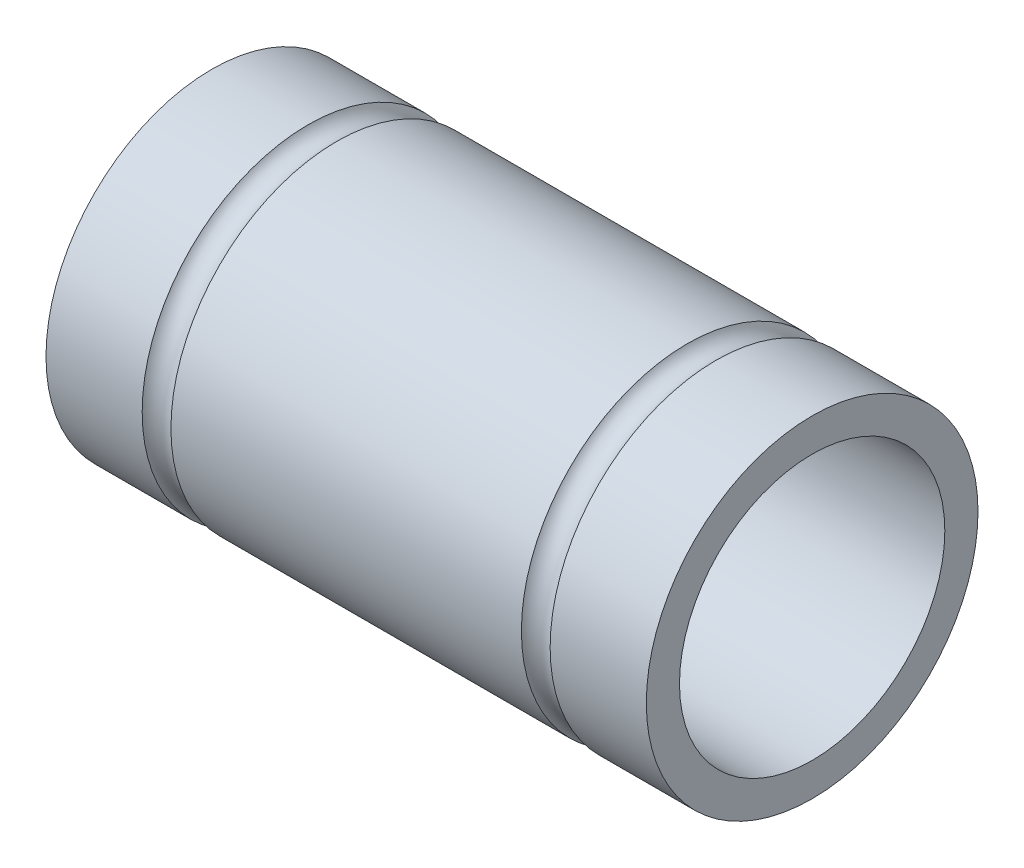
ISO-10303-21;
HEADER;
FILE_DESCRIPTION(('STEP AP214'),'2;1');
FILE_NAME('part.step','',(''),(''),'','','');
FILE_SCHEMA(('AUTOMOTIVE_DESIGN { 1 0 10303 214 1 1 1 1 }'));
ENDSEC;
DATA;
#1=APPLICATION_CONTEXT('core data for automotive mechanical design processes');
#2=APPLICATION_PROTOCOL_DEFINITION('international standard','automotive_design',2000,#1);
#3=PRODUCT_CONTEXT('',#1,'mechanical');
#4=PRODUCT('Part','Part','',(#3));
#5=PRODUCT_RELATED_PRODUCT_CATEGORY('part','',(#4));
#6=PRODUCT_DEFINITION_FORMATION('','',#4);
#7=PRODUCT_DEFINITION_CONTEXT('part definition',#1,'design');
#8=PRODUCT_DEFINITION('design','',#6,#7);
#9=PRODUCT_DEFINITION_SHAPE('','',#8);
#10=(LENGTH_UNIT() NAMED_UNIT(*) SI_UNIT(.MILLI.,.METRE.));
#11=(NAMED_UNIT(*) PLANE_ANGLE_UNIT() SI_UNIT($,.RADIAN.));
#12=(NAMED_UNIT(*) SI_UNIT($,.STERADIAN.) SOLID_ANGLE_UNIT());
#13=UNCERTAINTY_MEASURE_WITH_UNIT(LENGTH_MEASURE(1.E-05),#10,'distance_accuracy_value','');
#14=(GEOMETRIC_REPRESENTATION_CONTEXT(3) GLOBAL_UNCERTAINTY_ASSIGNED_CONTEXT((#13)) GLOBAL_UNIT_ASSIGNED_CONTEXT((#10,
#11,#12)) REPRESENTATION_CONTEXT('',''));
#15=CARTESIAN_POINT('',(0.,0.,0.));
#16=DIRECTION('',(0.,0.,1.));
#17=DIRECTION('',(1.,0.,0.));
#18=AXIS2_PLACEMENT_3D('',#15,#16,#17);
#19=CARTESIAN_POINT('',(-70.,15.,0.));
#20=DIRECTION('',(1.,0.,0.));
#21=DIRECTION('',(0.,0.,-1.));
#22=AXIS2_PLACEMENT_3D('',#19,#20,#21);
#23=PLANE('',#22);
#24=CARTESIAN_POINT('',(-70.,0.,0.));
#25=DIRECTION('',(-1.,0.,0.));
#26=DIRECTION('',(0.,0.,1.));
#27=AXIS2_PLACEMENT_3D('',#24,#25,#26);
#28=CIRCLE('',#27,12.);
#29=CARTESIAN_POINT('',(-70.,0.,12.));
#30=VERTEX_POINT('',#29);
#31=EDGE_CURVE('E10',#30,#30,#28,.T.);
#32=ORIENTED_EDGE('',*,*,#31,.F.);
#33=EDGE_LOOP('',(#32));
#34=FACE_BOUND('',#33,.T.);
#35=CARTESIAN_POINT('',(-70.,0.,0.));
#36=DIRECTION('',(-1.,0.,0.));
#37=DIRECTION('',(0.,0.,1.));
#38=AXIS2_PLACEMENT_3D('',#35,#36,#37);
#39=CIRCLE('',#38,15.);
#40=CARTESIAN_POINT('',(-70.,0.,15.));
#41=VERTEX_POINT('',#40);
#42=EDGE_CURVE('E60',#41,#41,#39,.T.);
#43=ORIENTED_EDGE('',*,*,#42,.T.);
#44=EDGE_LOOP('',(#43));
#45=FACE_BOUND('',#44,.T.);
#46=ADVANCED_FACE('F32',(#34,#45),#23,.F.);
#47=CARTESIAN_POINT('',(-100.,0.,0.));
#48=DIRECTION('',(-1.,0.,0.));
#49=DIRECTION('',(0.,0.,1.));
#50=AXIS2_PLACEMENT_3D('',#47,#48,#49);
#51=CYLINDRICAL_SURFACE('',#50,12.);
#52=CARTESIAN_POINT('',(-15.7,0.,0.));
#53=DIRECTION('',(-1.,0.,0.));
#54=DIRECTION('',(0.,0.,1.));
#55=AXIS2_PLACEMENT_3D('',#52,#53,#54);
#56=CIRCLE('',#55,12.);
#57=CARTESIAN_POINT('',(-15.7,0.,12.));
#58=VERTEX_POINT('',#57);
#59=EDGE_CURVE('E38',#58,#58,#56,.T.);
#60=ORIENTED_EDGE('',*,*,#59,.F.);
#61=EDGE_LOOP('',(#60));
#62=FACE_BOUND('',#61,.T.);
#63=ORIENTED_EDGE('',*,*,#31,.T.);
#64=EDGE_LOOP('',(#63));
#65=FACE_BOUND('',#64,.T.);
#66=ADVANCED_FACE('F97',(#62,#65),#51,.F.);
#67=CARTESIAN_POINT('',(-15.7,15.,0.));
#68=DIRECTION('',(-1.,0.,0.));
#69=DIRECTION('',(0.,0.,1.));
#70=AXIS2_PLACEMENT_3D('',#67,#68,#69);
#71=PLANE('',#70);
#72=CARTESIAN_POINT('',(-15.7,0.,0.));
#73=DIRECTION('',(-1.,0.,0.));
#74=DIRECTION('',(0.,0.,1.));
#75=AXIS2_PLACEMENT_3D('',#72,#73,#74);
#76=CIRCLE('',#75,15.);
#77=CARTESIAN_POINT('',(-15.7,0.,15.));
#78=VERTEX_POINT('',#77);
#79=EDGE_CURVE('E42',#78,#78,#76,.T.);
#80=ORIENTED_EDGE('',*,*,#79,.F.);
#81=EDGE_LOOP('',(#80));
#82=FACE_BOUND('',#81,.T.);
#83=ORIENTED_EDGE('',*,*,#59,.T.);
#84=EDGE_LOOP('',(#83));
#85=FACE_BOUND('',#84,.T.);
#86=ADVANCED_FACE('F92',(#82,#85),#71,.F.);
#87=CARTESIAN_POINT('',(-100.,0.,0.));
#88=DIRECTION('',(-1.,0.,0.));
#89=DIRECTION('',(0.,0.,1.));
#90=AXIS2_PLACEMENT_3D('',#87,#88,#89);
#91=CYLINDRICAL_SURFACE('',#90,15.);
#92=CARTESIAN_POINT('',(-24.4,0.,0.));
#93=DIRECTION('',(-1.,0.,0.));
#94=DIRECTION('',(0.,0.,1.));
#95=AXIS2_PLACEMENT_3D('',#92,#93,#94);
#96=CIRCLE('',#95,15.);
#97=CARTESIAN_POINT('',(-24.4,0.,15.));
#98=VERTEX_POINT('',#97);
#99=EDGE_CURVE('E46',#98,#98,#96,.T.);
#100=ORIENTED_EDGE('',*,*,#99,.F.);
#101=EDGE_LOOP('',(#100));
#102=FACE_BOUND('',#101,.T.);
#103=ORIENTED_EDGE('',*,*,#79,.T.);
#104=EDGE_LOOP('',(#103));
#105=FACE_BOUND('',#104,.T.);
#106=ADVANCED_FACE('F86',(#102,#105),#91,.T.);
#107=CARTESIAN_POINT('',(-25.7,0.,0.));
#108=DIRECTION('',(-1.,0.,0.));
#109=DIRECTION('',(0.,0.,1.));
#110=AXIS2_PLACEMENT_3D('',#107,#108,#109);
#111=TOROIDAL_SURFACE('',#110,15.7483314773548,1.5);
#112=CARTESIAN_POINT('',(-27.,0.,0.));
#113=DIRECTION('',(-1.,0.,0.));
#114=DIRECTION('',(0.,0.,1.));
#115=AXIS2_PLACEMENT_3D('',#112,#113,#114);
#116=CIRCLE('',#115,15.);
#117=CARTESIAN_POINT('',(-27.,0.,15.));
#118=VERTEX_POINT('',#117);
#119=EDGE_CURVE('E51',#118,#118,#116,.T.);
#120=ORIENTED_EDGE('',*,*,#119,.F.);
#121=EDGE_LOOP('',(#120));
#122=FACE_BOUND('',#121,.T.);
#123=ORIENTED_EDGE('',*,*,#99,.T.);
#124=EDGE_LOOP('',(#123));
#125=FACE_BOUND('',#124,.T.);
#126=ADVANCED_FACE('F80',(#122,#125),#111,.F.);
#127=CARTESIAN_POINT('',(-100.,0.,0.));
#128=DIRECTION('',(-1.,0.,0.));
#129=DIRECTION('',(0.,0.,1.));
#130=AXIS2_PLACEMENT_3D('',#127,#128,#129);
#131=CYLINDRICAL_SURFACE('',#130,15.);
#132=CARTESIAN_POINT('',(-58.7,0.,0.));
#133=DIRECTION('',(-1.,0.,0.));
#134=DIRECTION('',(0.,0.,1.));
#135=AXIS2_PLACEMENT_3D('',#132,#133,#134);
#136=CIRCLE('',#135,15.);
#137=CARTESIAN_POINT('',(-58.7,0.,15.));
#138=VERTEX_POINT('',#137);
#139=EDGE_CURVE('E54',#138,#138,#136,.T.);
#140=ORIENTED_EDGE('',*,*,#139,.F.);
#141=EDGE_LOOP('',(#140));
#142=FACE_BOUND('',#141,.T.);
#143=ORIENTED_EDGE('',*,*,#119,.T.);
#144=EDGE_LOOP('',(#143));
#145=FACE_BOUND('',#144,.T.);
#146=ADVANCED_FACE('F74',(#142,#145),#131,.T.);
#147=CARTESIAN_POINT('',(-60.,0.,0.));
#148=DIRECTION('',(-1.,0.,0.));
#149=DIRECTION('',(0.,0.,1.));
#150=AXIS2_PLACEMENT_3D('',#147,#148,#149);
#151=TOROIDAL_SURFACE('',#150,15.7483314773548,1.5);
#152=CARTESIAN_POINT('',(-61.3,0.,0.));
#153=DIRECTION('',(-1.,0.,0.));
#154=DIRECTION('',(0.,0.,1.));
#155=AXIS2_PLACEMENT_3D('',#152,#153,#154);
#156=CIRCLE('',#155,15.);
#157=CARTESIAN_POINT('',(-61.3,0.,15.));
#158=VERTEX_POINT('',#157);
#159=EDGE_CURVE('E57',#158,#158,#156,.T.);
#160=ORIENTED_EDGE('',*,*,#159,.F.);
#161=EDGE_LOOP('',(#160));
#162=FACE_BOUND('',#161,.T.);
#163=ORIENTED_EDGE('',*,*,#139,.T.);
#164=EDGE_LOOP('',(#163));
#165=FACE_BOUND('',#164,.T.);
#166=ADVANCED_FACE('F68',(#162,#165),#151,.F.);
#167=CARTESIAN_POINT('',(-100.,0.,0.));
#168=DIRECTION('',(-1.,0.,0.));
#169=DIRECTION('',(0.,0.,1.));
#170=AXIS2_PLACEMENT_3D('',#167,#168,#169);
#171=CYLINDRICAL_SURFACE('',#170,15.);
#172=ORIENTED_EDGE('',*,*,#42,.F.);
#173=EDGE_LOOP('',(#172));
#174=FACE_BOUND('',#173,.T.);
#175=ORIENTED_EDGE('',*,*,#159,.T.);
#176=EDGE_LOOP('',(#175));
#177=FACE_BOUND('',#176,.T.);
#178=ADVANCED_FACE('F65',(#174,#177),#171,.T.);
#179=CLOSED_SHELL('',(#46,#66,#86,#106,#126,#146,#166,#178));
#180=MANIFOLD_SOLID_BREP('B2',#179);
#181=ADVANCED_BREP_SHAPE_REPRESENTATION('',(#18,#180),#14);
#182=SHAPE_DEFINITION_REPRESENTATION(#9,#181);
ENDSEC;
END-ISO-10303-21;
